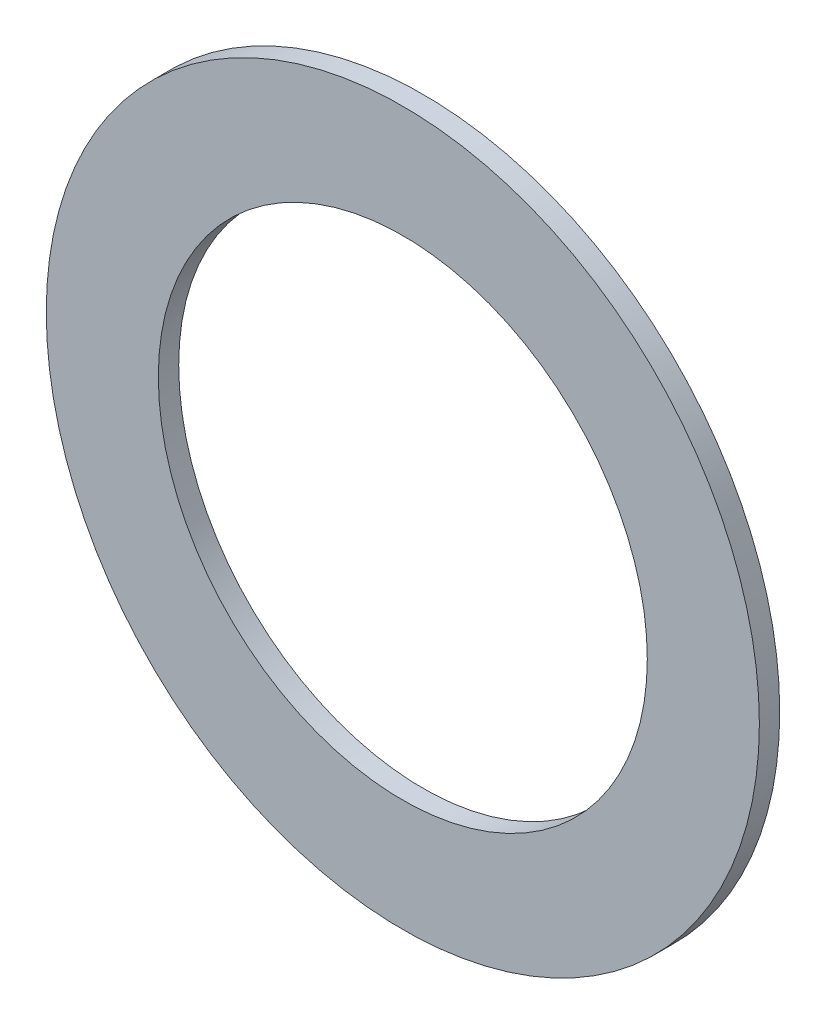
from build123d import *

# Parameters (mm, degrees)
ESQUISSE1_R          = 35
ESQUISSE1_R_2        = 24
BASE_EXTRUSION_DEPTH = 2


with BuildPart() as part:
    # Esquisse1 → Base-Extrusion (new body)
    with BuildSketch(Plane.XY):
        Circle(ESQUISSE1_R)
        Circle(ESQUISSE1_R_2, mode=Mode.SUBTRACT)
    extrude(amount=BASE_EXTRUSION_DEPTH)


solid = part.part
